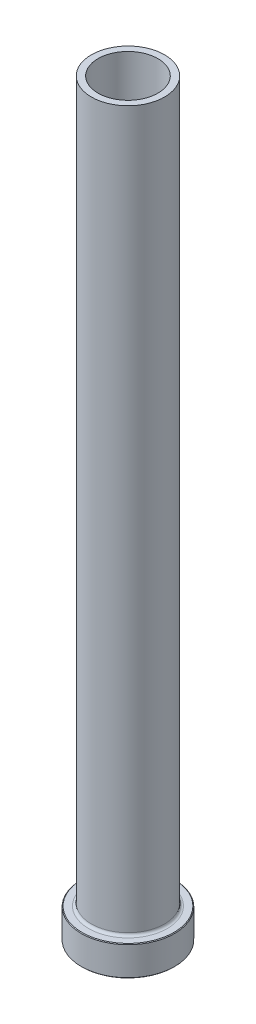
from build123d import *

# Parameters (mm, degrees)
FILLET1_R     = 0.8
CHAMFER1_SIZE = 0.2
CHAMFER3_SIZE = 0.5


with BuildPart() as part:
    # Sketch1 → Revolve1 (revolve)
    with BuildSketch(Plane.XY, mode=Mode.PRIVATE) as revolve1_sk:
        Polygon((-9, 225), (-11, 225), (-11, 9), (-14, 9), (-14, 0), (-9.25, 0), (-9.25, 158), (-9, 170), align=None)
    revolve(revolve1_sk.sketch.rotate(Axis((0, 92.187680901, 0), (0, -1, 0)), 270), axis=Axis((0, 92.187680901, 0), (0, -1, 0)))

    # Fillet1
    fillet1_edges = [part.edges().sort_by_distance(p)[0] for p in [
        (0, 9, -11),
    ]]
    fillet(fillet1_edges, radius=FILLET1_R)

    # Chamfer1
    chamfer1_edges = [part.edges().sort_by_distance(p)[0] for p in [
        (0, 0, -14),
        (0, 9, -14),
    ]]
    chamfer(chamfer1_edges, length=CHAMFER1_SIZE)

    # Chamfer3
    chamfer3_edges = [part.edges().sort_by_distance(p)[0] for p in [
        (0, 0, -9.25),
    ]]
    chamfer(chamfer3_edges, length=CHAMFER3_SIZE)


solid = part.part
